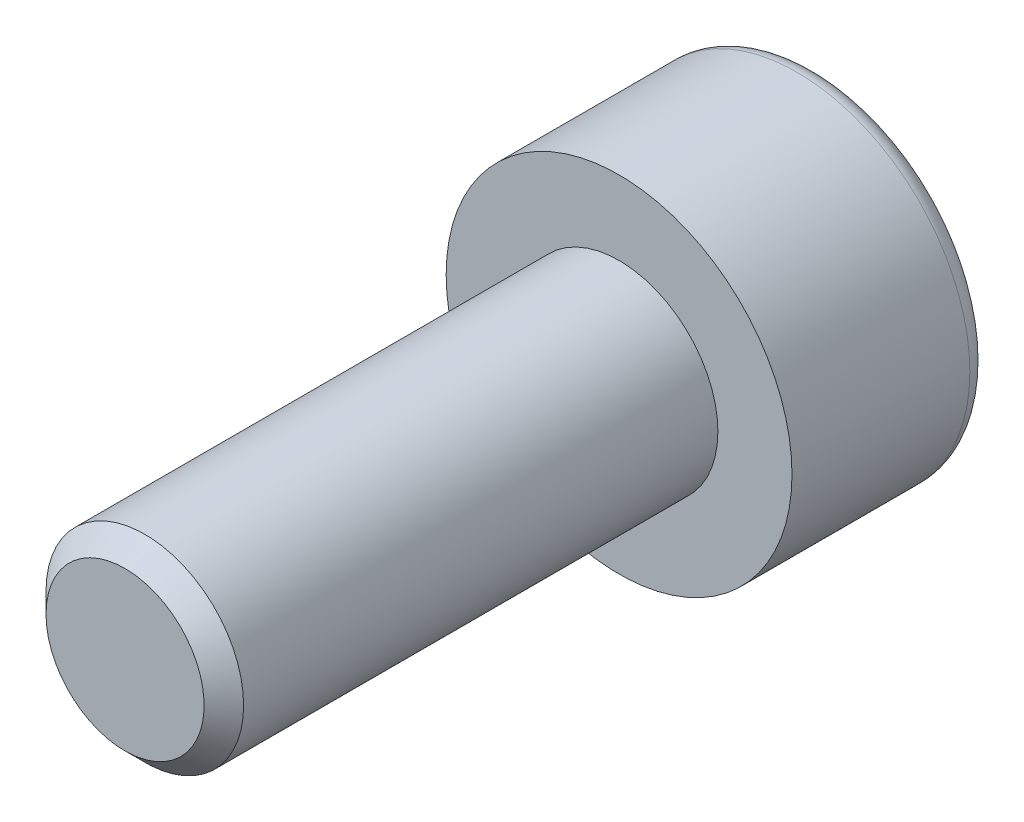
from build123d import *

# Parameters (mm, degrees)
ENLEV_MAT_EXTRU1_DEPTH = 2
ESQUISSE3_W            = 2
ESQUISSE3_H            = 10
CHANFREIN1_SIZE        = 0.4


with BuildPart() as part:
    # Esquisse1 → Base-R_volution (revolve)
    with BuildSketch(Plane(origin=(0, 0, 0), x_dir=(1, 0, 0), z_dir=(0, 1, 0)), mode=Mode.PRIVATE) as base_r_volution_sk:
        with BuildLine():
            Line((0, 0), (3.5, 0))
            Line((3.5, 0), (3.5, 3.6))
            ThreePointArc((3.5, 3.6), (3.382842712, 3.882842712), (3.1, 4))
            Line((3.1, 4), (0, 4))
            Line((0, 4), (0, 0))
        make_face()
    revolve(base_r_volution_sk.sketch.rotate(Axis((0, 0, 0), (0, 0, -1)), 180), axis=Axis((0, 0, 0), (0, 0, -1)))

    # Esquisse2 → enlev-mat-Extru1 (cut)
    with BuildSketch(Plane.XY.offset(-4)):
        Polygon((1.5, -0.866025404), (1.5, 0.866025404), (0, 1.732050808), (-1.5, 0.866025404), (-1.5, -0.866025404), (0, -1.732050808), align=None)
    extrude(amount=ENLEV_MAT_EXTRU1_DEPTH, mode=Mode.SUBTRACT)

    # Esquisse3 → Boss.-R_vol.1 (revolve)
    with BuildSketch(Plane(origin=(0, 0, 0), x_dir=(1, 0, 0), z_dir=(0, 1, 0))):
        with Locations((1, -5)):
            Rectangle(ESQUISSE3_W, ESQUISSE3_H)
    revolve(axis=Axis((0, 0, 0), (0, 0, 1)))

    # Chanfrein1
    chanfrein1_edges = [part.edges().sort_by_distance(p)[0] for p in [
        (-2, 0, 10),
    ]]
    chamfer(chanfrein1_edges, length=CHANFREIN1_SIZE)


solid = part.part
